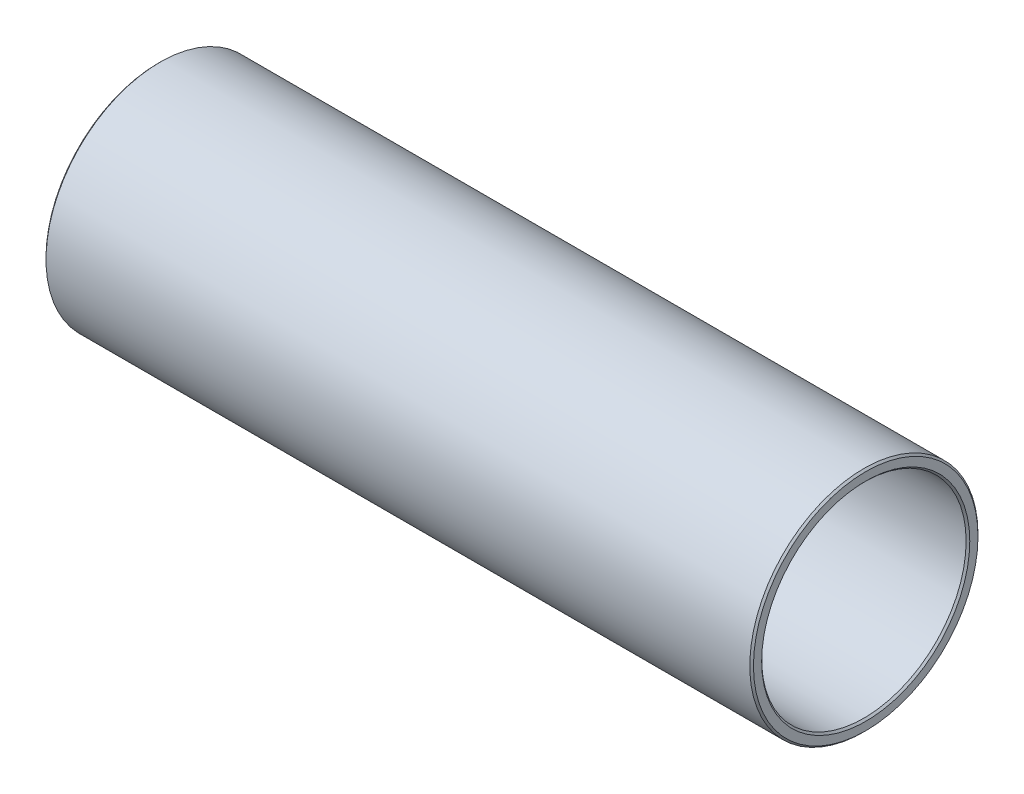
ISO-10303-21;
HEADER;
FILE_DESCRIPTION(('STEP AP214'),'2;1');
FILE_NAME('part.step','',(''),(''),'','','');
FILE_SCHEMA(('AUTOMOTIVE_DESIGN { 1 0 10303 214 1 1 1 1 }'));
ENDSEC;
DATA;
#1=APPLICATION_CONTEXT('core data for automotive mechanical design processes');
#2=APPLICATION_PROTOCOL_DEFINITION('international standard','automotive_design',2000,#1);
#3=PRODUCT_CONTEXT('',#1,'mechanical');
#4=PRODUCT('Part','Part','',(#3));
#5=PRODUCT_RELATED_PRODUCT_CATEGORY('part','',(#4));
#6=PRODUCT_DEFINITION_FORMATION('','',#4);
#7=PRODUCT_DEFINITION_CONTEXT('part definition',#1,'design');
#8=PRODUCT_DEFINITION('design','',#6,#7);
#9=PRODUCT_DEFINITION_SHAPE('','',#8);
#10=(LENGTH_UNIT() NAMED_UNIT(*) SI_UNIT(.MILLI.,.METRE.));
#11=(NAMED_UNIT(*) PLANE_ANGLE_UNIT() SI_UNIT($,.RADIAN.));
#12=(NAMED_UNIT(*) SI_UNIT($,.STERADIAN.) SOLID_ANGLE_UNIT());
#13=UNCERTAINTY_MEASURE_WITH_UNIT(LENGTH_MEASURE(1.E-05),#10,'distance_accuracy_value','');
#14=(GEOMETRIC_REPRESENTATION_CONTEXT(3) GLOBAL_UNCERTAINTY_ASSIGNED_CONTEXT((#13)) GLOBAL_UNIT_ASSIGNED_CONTEXT((#10,
#11,#12)) REPRESENTATION_CONTEXT('',''));
#15=CARTESIAN_POINT('',(0.,0.,0.));
#16=DIRECTION('',(0.,0.,1.));
#17=DIRECTION('',(1.,0.,0.));
#18=AXIS2_PLACEMENT_3D('',#15,#16,#17);
#19=CARTESIAN_POINT('',(98.425,0.,0.));
#20=DIRECTION('',(1.,0.,0.));
#21=DIRECTION('',(0.,0.,-1.));
#22=AXIS2_PLACEMENT_3D('',#19,#20,#21);
#23=PLANE('',#22);
#24=CARTESIAN_POINT('',(98.425,0.,0.));
#25=DIRECTION('',(1.,0.,0.));
#26=DIRECTION('',(0.,0.,-1.));
#27=AXIS2_PLACEMENT_3D('',#24,#25,#26);
#28=CIRCLE('',#27,14.478);
#29=CARTESIAN_POINT('',(98.425,0.,-14.478));
#30=VERTEX_POINT('',#29);
#31=EDGE_CURVE('E10',#30,#30,#28,.F.);
#32=ORIENTED_EDGE('',*,*,#31,.T.);
#33=EDGE_LOOP('',(#32));
#34=FACE_BOUND('',#33,.T.);
#35=CARTESIAN_POINT('',(98.425,0.,0.));
#36=DIRECTION('',(1.,0.,0.));
#37=DIRECTION('',(0.,0.,-1.));
#38=AXIS2_PLACEMENT_3D('',#35,#36,#37);
#39=CIRCLE('',#38,15.621);
#40=CARTESIAN_POINT('',(98.425,0.,-15.621));
#41=VERTEX_POINT('',#40);
#42=EDGE_CURVE('E39',#41,#41,#39,.T.);
#43=ORIENTED_EDGE('',*,*,#42,.T.);
#44=EDGE_LOOP('',(#43));
#45=FACE_BOUND('',#44,.T.);
#46=ADVANCED_FACE('F32',(#34,#45),#23,.T.);
#47=CARTESIAN_POINT('',(0.,0.,0.));
#48=DIRECTION('',(1.,0.,0.));
#49=DIRECTION('',(0.,0.,-1.));
#50=AXIS2_PLACEMENT_3D('',#47,#48,#49);
#51=PLANE('',#50);
#52=CARTESIAN_POINT('',(0.,0.,0.));
#53=DIRECTION('',(1.,0.,0.));
#54=DIRECTION('',(0.,0.,-1.));
#55=AXIS2_PLACEMENT_3D('',#52,#53,#54);
#56=CIRCLE('',#55,14.478);
#57=CARTESIAN_POINT('',(0.,0.,-14.478));
#58=VERTEX_POINT('',#57);
#59=EDGE_CURVE('E58',#58,#58,#56,.T.);
#60=ORIENTED_EDGE('',*,*,#59,.T.);
#61=EDGE_LOOP('',(#60));
#62=FACE_BOUND('',#61,.T.);
#63=CARTESIAN_POINT('',(0.,0.,0.));
#64=DIRECTION('',(1.,0.,0.));
#65=DIRECTION('',(0.,0.,-1.));
#66=AXIS2_PLACEMENT_3D('',#63,#64,#65);
#67=CIRCLE('',#66,15.621);
#68=CARTESIAN_POINT('',(0.,0.,-15.621));
#69=VERTEX_POINT('',#68);
#70=EDGE_CURVE('E61',#69,#69,#67,.F.);
#71=ORIENTED_EDGE('',*,*,#70,.T.);
#72=EDGE_LOOP('',(#71));
#73=FACE_BOUND('',#72,.T.);
#74=ADVANCED_FACE('F65',(#62,#73),#51,.F.);
#75=CARTESIAN_POINT('',(98.425,0.,0.));
#76=DIRECTION('',(-1.,0.,0.));
#77=DIRECTION('',(0.,0.,1.));
#78=AXIS2_PLACEMENT_3D('',#75,#76,#77);
#79=CYLINDRICAL_SURFACE('',#78,15.875);
#80=CARTESIAN_POINT('',(0.254000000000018,0.,0.));
#81=DIRECTION('',(1.,0.,0.));
#82=DIRECTION('',(0.,0.,-1.));
#83=AXIS2_PLACEMENT_3D('',#80,#81,#82);
#84=CIRCLE('',#83,15.875);
#85=CARTESIAN_POINT('',(0.254000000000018,0.,-15.875));
#86=VERTEX_POINT('',#85);
#87=EDGE_CURVE('E43',#86,#86,#84,.T.);
#88=ORIENTED_EDGE('',*,*,#87,.T.);
#89=EDGE_LOOP('',(#88));
#90=FACE_BOUND('',#89,.T.);
#91=CARTESIAN_POINT('',(98.171,0.,0.));
#92=DIRECTION('',(1.,0.,0.));
#93=DIRECTION('',(0.,0.,-1.));
#94=AXIS2_PLACEMENT_3D('',#91,#92,#93);
#95=CIRCLE('',#94,15.875);
#96=CARTESIAN_POINT('',(98.171,0.,-15.875));
#97=VERTEX_POINT('',#96);
#98=EDGE_CURVE('E47',#97,#97,#95,.F.);
#99=ORIENTED_EDGE('',*,*,#98,.T.);
#100=EDGE_LOOP('',(#99));
#101=FACE_BOUND('',#100,.T.);
#102=ADVANCED_FACE('F75',(#90,#101),#79,.T.);
#103=CARTESIAN_POINT('',(98.425,0.,0.));
#104=DIRECTION('',(-1.,0.,0.));
#105=DIRECTION('',(0.,0.,1.));
#106=AXIS2_PLACEMENT_3D('',#103,#104,#105);
#107=CYLINDRICAL_SURFACE('',#106,14.224);
#108=CARTESIAN_POINT('',(0.254000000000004,0.,0.));
#109=DIRECTION('',(1.,0.,0.));
#110=DIRECTION('',(0.,0.,-1.));
#111=AXIS2_PLACEMENT_3D('',#108,#109,#110);
#112=CIRCLE('',#111,14.224);
#113=CARTESIAN_POINT('',(0.254000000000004,0.,-14.224));
#114=VERTEX_POINT('',#113);
#115=EDGE_CURVE('E52',#114,#114,#112,.F.);
#116=ORIENTED_EDGE('',*,*,#115,.T.);
#117=EDGE_LOOP('',(#116));
#118=FACE_BOUND('',#117,.T.);
#119=CARTESIAN_POINT('',(98.171,0.,0.));
#120=DIRECTION('',(1.,0.,0.));
#121=DIRECTION('',(0.,0.,-1.));
#122=AXIS2_PLACEMENT_3D('',#119,#120,#121);
#123=CIRCLE('',#122,14.224);
#124=CARTESIAN_POINT('',(98.171,0.,-14.224));
#125=VERTEX_POINT('',#124);
#126=EDGE_CURVE('E55',#125,#125,#123,.T.);
#127=ORIENTED_EDGE('',*,*,#126,.T.);
#128=EDGE_LOOP('',(#127));
#129=FACE_BOUND('',#128,.T.);
#130=ADVANCED_FACE('F78',(#118,#129),#107,.F.);
#131=CARTESIAN_POINT('',(0.,0.,0.));
#132=DIRECTION('',(-1.,0.,0.));
#133=DIRECTION('',(0.,0.,1.));
#134=AXIS2_PLACEMENT_3D('',#131,#132,#133);
#135=CONICAL_SURFACE('',#134,14.478,0.785398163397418);
#136=ORIENTED_EDGE('',*,*,#115,.F.);
#137=EDGE_LOOP('',(#136));
#138=FACE_BOUND('',#137,.T.);
#139=ORIENTED_EDGE('',*,*,#59,.F.);
#140=EDGE_LOOP('',(#139));
#141=FACE_BOUND('',#140,.T.);
#142=ADVANCED_FACE('F71',(#138,#141),#135,.F.);
#143=CARTESIAN_POINT('',(0.254000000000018,0.,0.));
#144=DIRECTION('',(1.,0.,0.));
#145=DIRECTION('',(0.,0.,-1.));
#146=AXIS2_PLACEMENT_3D('',#143,#144,#145);
#147=CONICAL_SURFACE('',#146,15.875,0.785398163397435);
#148=ORIENTED_EDGE('',*,*,#70,.F.);
#149=EDGE_LOOP('',(#148));
#150=FACE_BOUND('',#149,.T.);
#151=ORIENTED_EDGE('',*,*,#87,.F.);
#152=EDGE_LOOP('',(#151));
#153=FACE_BOUND('',#152,.T.);
#154=ADVANCED_FACE('F67',(#150,#153),#147,.T.);
#155=CARTESIAN_POINT('',(98.171,0.,0.));
#156=DIRECTION('',(1.,0.,0.));
#157=DIRECTION('',(0.,0.,-1.));
#158=AXIS2_PLACEMENT_3D('',#155,#156,#157);
#159=CONICAL_SURFACE('',#158,14.224,0.785398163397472);
#160=ORIENTED_EDGE('',*,*,#31,.F.);
#161=EDGE_LOOP('',(#160));
#162=FACE_BOUND('',#161,.T.);
#163=ORIENTED_EDGE('',*,*,#126,.F.);
#164=EDGE_LOOP('',(#163));
#165=FACE_BOUND('',#164,.T.);
#166=ADVANCED_FACE('F70',(#162,#165),#159,.F.);
#167=CARTESIAN_POINT('',(98.425,0.,0.));
#168=DIRECTION('',(-1.,0.,0.));
#169=DIRECTION('',(0.,0.,1.));
#170=AXIS2_PLACEMENT_3D('',#167,#168,#169);
#171=CONICAL_SURFACE('',#170,15.621,0.785398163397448);
#172=ORIENTED_EDGE('',*,*,#98,.F.);
#173=EDGE_LOOP('',(#172));
#174=FACE_BOUND('',#173,.T.);
#175=ORIENTED_EDGE('',*,*,#42,.F.);
#176=EDGE_LOOP('',(#175));
#177=FACE_BOUND('',#176,.T.);
#178=ADVANCED_FACE('F34',(#174,#177),#171,.T.);
#179=CLOSED_SHELL('',(#46,#74,#102,#130,#142,#154,#166,#178));
#180=MANIFOLD_SOLID_BREP('B2',#179);
#181=ADVANCED_BREP_SHAPE_REPRESENTATION('',(#18,#180),#14);
#182=SHAPE_DEFINITION_REPRESENTATION(#9,#181);
ENDSEC;
END-ISO-10303-21;
